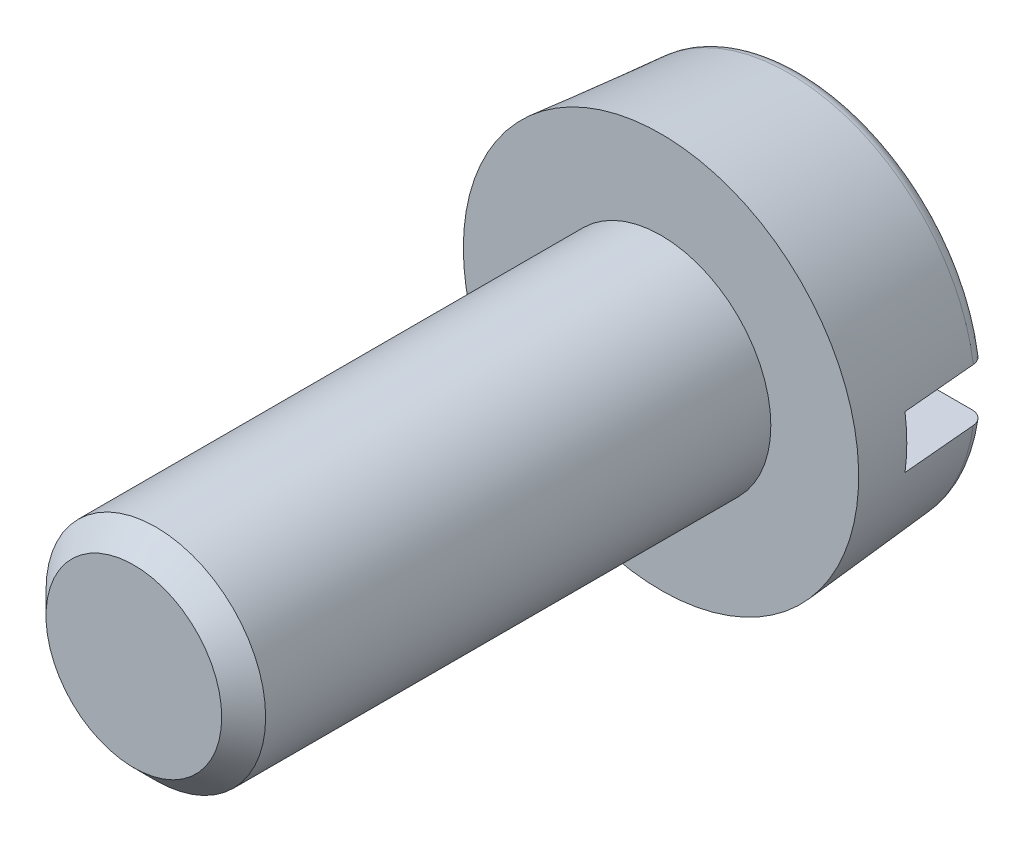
ISO-10303-21;
HEADER;
FILE_DESCRIPTION(('STEP AP214'),'2;1');
FILE_NAME('part.step','',(''),(''),'','','');
FILE_SCHEMA(('AUTOMOTIVE_DESIGN { 1 0 10303 214 1 1 1 1 }'));
ENDSEC;
DATA;
#1=APPLICATION_CONTEXT('core data for automotive mechanical design processes');
#2=APPLICATION_PROTOCOL_DEFINITION('international standard','automotive_design',2000,#1);
#3=PRODUCT_CONTEXT('',#1,'mechanical');
#4=PRODUCT('Part','Part','',(#3));
#5=PRODUCT_RELATED_PRODUCT_CATEGORY('part','',(#4));
#6=PRODUCT_DEFINITION_FORMATION('','',#4);
#7=PRODUCT_DEFINITION_CONTEXT('part definition',#1,'design');
#8=PRODUCT_DEFINITION('design','',#6,#7);
#9=PRODUCT_DEFINITION_SHAPE('','',#8);
#10=(LENGTH_UNIT() NAMED_UNIT(*) SI_UNIT(.MILLI.,.METRE.));
#11=(NAMED_UNIT(*) PLANE_ANGLE_UNIT() SI_UNIT($,.RADIAN.));
#12=(NAMED_UNIT(*) SI_UNIT($,.STERADIAN.) SOLID_ANGLE_UNIT());
#13=UNCERTAINTY_MEASURE_WITH_UNIT(LENGTH_MEASURE(1.E-05),#10,'distance_accuracy_value','');
#14=(GEOMETRIC_REPRESENTATION_CONTEXT(3) GLOBAL_UNCERTAINTY_ASSIGNED_CONTEXT((#13)) GLOBAL_UNIT_ASSIGNED_CONTEXT((#10,
#11,#12)) REPRESENTATION_CONTEXT('',''));
#15=CARTESIAN_POINT('',(0.,0.,0.));
#16=DIRECTION('',(0.,0.,1.));
#17=DIRECTION('',(1.,0.,0.));
#18=AXIS2_PLACEMENT_3D('',#15,#16,#17);
#19=CARTESIAN_POINT('',(0.,0.,-1.6));
#20=DIRECTION('',(0.,0.,1.));
#21=DIRECTION('',(1.,0.,0.));
#22=AXIS2_PLACEMENT_3D('',#19,#20,#21);
#23=PLANE('',#22);
#24=DIRECTION('',(1.,0.,0.));
#25=VECTOR('',#24,1.);
#26=CARTESIAN_POINT('',(-2.25,-0.3,-1.6));
#27=LINE('',#26,#25);
#28=CARTESIAN_POINT('',(-1.94035042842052,-0.3,-1.6));
#29=VERTEX_POINT('',#28);
#30=CARTESIAN_POINT('',(1.94035042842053,-0.3,-1.6));
#31=VERTEX_POINT('',#30);
#32=EDGE_CURVE('E180',#29,#31,#27,.T.);
#33=ORIENTED_EDGE('',*,*,#32,.T.);
#34=CARTESIAN_POINT('',(0.,0.,-1.6));
#35=DIRECTION('',(0.,0.,-1.));
#36=DIRECTION('',(-1.,0.,0.));
#37=AXIS2_PLACEMENT_3D('',#34,#35,#36);
#38=CIRCLE('',#37,1.96340515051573);
#39=EDGE_CURVE('E110',#31,#29,#38,.T.);
#40=ORIENTED_EDGE('',*,*,#39,.T.);
#41=EDGE_LOOP('',(#33,#40));
#42=FACE_BOUND('',#41,.T.);
#43=ADVANCED_FACE('F29',(#42),#23,.F.);
#44=DIRECTION('',(-1.,0.,0.));
#45=VECTOR('',#44,1.);
#46=CARTESIAN_POINT('',(-2.25,0.3,-1.6));
#47=LINE('',#46,#45);
#48=CARTESIAN_POINT('',(1.94035042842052,0.3,-1.6));
#49=VERTEX_POINT('',#48);
#50=CARTESIAN_POINT('',(-1.94035042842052,0.3,-1.6));
#51=VERTEX_POINT('',#50);
#52=EDGE_CURVE('E97',#49,#51,#47,.T.);
#53=ORIENTED_EDGE('',*,*,#52,.T.);
#54=EDGE_CURVE('E107',#51,#49,#38,.T.);
#55=ORIENTED_EDGE('',*,*,#54,.T.);
#56=EDGE_LOOP('',(#53,#55));
#57=FACE_BOUND('',#56,.T.);
#58=ADVANCED_FACE('F174',(#57),#23,.F.);
#59=CARTESIAN_POINT('',(0.,0.,-1.44));
#60=DIRECTION('',(0.,0.,-1.));
#61=DIRECTION('',(-1.,0.,0.));
#62=AXIS2_PLACEMENT_3D('',#59,#60,#61);
#63=TOROIDAL_SURFACE('',#62,1.96340515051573,0.16);
#64=CARTESIAN_POINT('',(-2.06921525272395,-0.3,-1.53673639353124));
#65=CARTESIAN_POINT('',(-2.0746550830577,-0.3,-1.52964326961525));
#66=CARTESIAN_POINT('',(-2.0795032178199,-0.3,-1.52208864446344));
#67=CARTESIAN_POINT('',(-2.08786804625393,-0.3,-1.50626748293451));
#68=CARTESIAN_POINT('',(-2.09138328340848,-0.3,-1.49800017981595));
#69=CARTESIAN_POINT('',(-2.09697215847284,-0.3,-1.48099261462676));
#70=CARTESIAN_POINT('',(-2.09904607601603,-0.3,-1.47225244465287));
#71=CARTESIAN_POINT('',(-2.1016898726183,-0.3,-1.45454966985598));
#72=CARTESIAN_POINT('',(-2.10226010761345,-0.3,-1.44558711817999));
#73=CARTESIAN_POINT('',(-2.10188127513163,-0.3,-1.42772878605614));
#74=CARTESIAN_POINT('',(-2.10093804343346,-0.3,-1.41883288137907));
#75=CARTESIAN_POINT('',(-2.09757146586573,-0.3,-1.4013255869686));
#76=CARTESIAN_POINT('',(-2.09514808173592,-0.3,-1.39271420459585));
#77=CARTESIAN_POINT('',(-2.08889300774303,-0.3,-1.3760180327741));
#78=CARTESIAN_POINT('',(-2.08506112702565,-0.3,-1.36793331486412));
#79=CARTESIAN_POINT('',(-2.07610212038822,-0.3,-1.35251685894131));
#80=CARTESIAN_POINT('',(-2.07097496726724,-0.3,-1.34518513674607));
#81=CARTESIAN_POINT('',(-2.05954034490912,-0.3,-1.33143462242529));
#82=CARTESIAN_POINT('',(-2.0532260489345,-0.3,-1.3250215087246));
#83=CARTESIAN_POINT('',(-2.03961957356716,-0.3,-1.31333402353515));
#84=CARTESIAN_POINT('',(-2.03232734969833,-0.3,-1.30805970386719));
#85=CARTESIAN_POINT('',(-2.01689652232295,-0.3,-1.29874428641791));
#86=CARTESIAN_POINT('',(-2.0087503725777,-0.3,-1.29471568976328));
#87=CARTESIAN_POINT('',(-1.99190207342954,-0.3,-1.28806773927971));
#88=CARTESIAN_POINT('',(-1.98319989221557,-0.3,-1.28544846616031));
#89=CARTESIAN_POINT('',(-1.9653927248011,-0.3,-1.28166733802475));
#90=CARTESIAN_POINT('',(-1.95628456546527,-0.3,-1.28052042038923));
#91=CARTESIAN_POINT('',(-1.9380044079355,-0.3,-1.27976148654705));
#92=CARTESIAN_POINT('',(-1.92883240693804,-0.3,-1.28014953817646));
#93=CARTESIAN_POINT('',(-1.91062403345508,-0.3,-1.28245633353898));
#94=CARTESIAN_POINT('',(-1.90158887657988,-0.3,-1.28438468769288));
#95=CARTESIAN_POINT('',(-1.8839706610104,-0.3,-1.28973193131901));
#96=CARTESIAN_POINT('',(-1.87538760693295,-0.3,-1.29315083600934));
#97=CARTESIAN_POINT('',(-1.85892739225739,-0.3,-1.30138357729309));
#98=CARTESIAN_POINT('',(-1.85104964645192,-0.3,-1.30619624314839));
#99=CARTESIAN_POINT('',(-1.83622296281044,-0.3,-1.31708660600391));
#100=CARTESIAN_POINT('',(-1.8292739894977,-0.3,-1.32316425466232));
#101=CARTESIAN_POINT('',(-1.81656874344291,-0.3,-1.33635833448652));
#102=CARTESIAN_POINT('',(-1.81080270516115,-0.3,-1.34346535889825));
#103=CARTESIAN_POINT('',(-1.80056433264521,-0.3,-1.35855724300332));
#104=CARTESIAN_POINT('',(-1.79609190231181,-0.3,-1.36654203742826));
#105=CARTESIAN_POINT('',(-1.78862931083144,-0.3,-1.3830515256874));
#106=CARTESIAN_POINT('',(-1.78562063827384,-0.3,-1.39156785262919));
#107=CARTESIAN_POINT('',(-1.78109353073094,-0.3,-1.40898771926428));
#108=CARTESIAN_POINT('',(-1.77957499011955,-0.3,-1.41789123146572));
#109=CARTESIAN_POINT('',(-1.77808415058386,-0.3,-1.43572905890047));
#110=CARTESIAN_POINT('',(-1.7780952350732,-0.3,-1.44466198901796));
#111=CARTESIAN_POINT('',(-1.77962174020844,-0.3,-1.46239814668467));
#112=CARTESIAN_POINT('',(-1.78113711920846,-0.3,-1.47120137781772));
#113=CARTESIAN_POINT('',(-1.78561880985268,-0.3,-1.48840356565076));
#114=CARTESIAN_POINT('',(-1.78858103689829,-0.3,-1.49680358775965));
#115=CARTESIAN_POINT('',(-1.7958645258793,-0.3,-1.51299186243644));
#116=CARTESIAN_POINT('',(-1.80018582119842,-0.3,-1.52078009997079));
#117=CARTESIAN_POINT('',(-1.81009248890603,-0.3,-1.53558192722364));
#118=CARTESIAN_POINT('',(-1.81568615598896,-0.3,-1.54258996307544));
#119=CARTESIAN_POINT('',(-1.82795738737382,-0.3,-1.55558203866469));
#120=CARTESIAN_POINT('',(-1.83463502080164,-0.3,-1.56156601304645));
#121=CARTESIAN_POINT('',(-1.84897346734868,-0.3,-1.57241987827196));
#122=CARTESIAN_POINT('',(-1.8566455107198,-0.3,-1.57727493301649));
#123=CARTESIAN_POINT('',(-1.87268838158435,-0.3,-1.58564579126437));
#124=CARTESIAN_POINT('',(-1.88105925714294,-0.3,-1.58916150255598));
#125=CARTESIAN_POINT('',(-1.89836915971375,-0.3,-1.59479508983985));
#126=CARTESIAN_POINT('',(-1.90731375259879,-0.3,-1.59689587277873));
#127=CARTESIAN_POINT('',(-1.92542786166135,-0.3,-1.59957571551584));
#128=CARTESIAN_POINT('',(-1.93459737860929,-0.3,-1.60015477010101));
#129=CARTESIAN_POINT('',(-1.95295751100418,-0.3,-1.59977353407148));
#130=CARTESIAN_POINT('',(-1.96214794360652,-0.3,-1.59880435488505));
#131=CARTESIAN_POINT('',(-1.98023748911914,-0.3,-1.59533333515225));
#132=CARTESIAN_POINT('',(-1.98913652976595,-0.3,-1.59283111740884));
#133=CARTESIAN_POINT('',(-2.00637042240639,-0.3,-1.58636553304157));
#134=CARTESIAN_POINT('',(-2.01470613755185,-0.3,-1.58240446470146));
#135=CARTESIAN_POINT('',(-2.03057891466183,-0.3,-1.57313009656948));
#136=CARTESIAN_POINT('',(-2.0381169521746,-0.3,-1.56781847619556));
#137=CARTESIAN_POINT('',(-2.04959677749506,-0.3,-1.55816464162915));
#138=CARTESIAN_POINT('',(-2.05384442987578,-0.3,-1.55418005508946));
#139=CARTESIAN_POINT('',(-2.06188335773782,-0.3,-1.54577427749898));
#140=CARTESIAN_POINT('',(-2.06567463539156,-0.3,-1.54135308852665));
#141=CARTESIAN_POINT('',(-2.06921525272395,-0.3,-1.53673639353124));
#142=B_SPLINE_CURVE_WITH_KNOTS('',3,(#64,#65,#66,#67,#68,#69,#70,#71,#72,#73,#74,#75,#76,#77,
#78,#79,#80,#81,#82,#83,#84,#85,#86,#87,#88,#89,#90,#91,#92,#93,#94,#95,#96,#97,#98,#99,#100,
#101,#102,#103,#104,#105,#106,#107,#108,#109,#110,#111,#112,#113,#114,#115,#116,#117,#118,#119,
#120,#121,#122,#123,#124,#125,#126,#127,#128,#129,#130,#131,#132,#133,#134,#135,#136,#137,#138,
#139,#140,#141),.UNSPECIFIED.,.T.,.F.,(4,2,2,2,2,2,2,2,2,2,2,2,2,2,2,2,2,2,2,2,2,2,2,2,2,2,2,2,
2,2,2,2,2,2,2,2,2,2,4),(0.,0.0267957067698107,0.0536206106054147,0.0804403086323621,
0.107253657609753,0.133963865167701,0.160674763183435,0.187389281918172,0.214104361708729,
0.240978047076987,0.267852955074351,0.294989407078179,0.322127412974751,0.349538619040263,
0.376951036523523,0.404535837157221,0.432120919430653,0.459682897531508,0.487243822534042,
0.514567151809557,0.54188845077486,0.568854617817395,0.595818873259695,0.622490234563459,
0.649160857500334,0.675756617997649,0.702353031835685,0.729128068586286,0.755904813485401,
0.783015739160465,0.810128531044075,0.837563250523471,0.864998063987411,0.892590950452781,
0.920190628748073,0.947747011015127,0.975269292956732,0.992709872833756,1.0101503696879),.UNSPECIFIED.);
#143=CARTESIAN_POINT('',(-2.10149093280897,-0.3,-1.45394491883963));
#144=VERTEX_POINT('',#143);
#145=EDGE_CURVE('E87',#29,#144,#142,.T.);
#146=ORIENTED_EDGE('',*,*,#145,.F.);
#147=ORIENTED_EDGE('',*,*,#39,.F.);
#148=CARTESIAN_POINT('',(1.80073063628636,-0.3,-1.5212145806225));
#149=CARTESIAN_POINT('',(1.79616751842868,-0.3,-1.51357358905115));
#150=CARTESIAN_POINT('',(1.79224189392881,-0.3,-1.50554488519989));
#151=CARTESIAN_POINT('',(1.78578922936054,-0.3,-1.48893672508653));
#152=CARTESIAN_POINT('',(1.78326367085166,-0.3,-1.48035669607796));
#153=CARTESIAN_POINT('',(1.77969332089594,-0.3,-1.46289428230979));
#154=CARTESIAN_POINT('',(1.77864829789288,-0.3,-1.45401194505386));
#155=CARTESIAN_POINT('',(1.7780715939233,-0.3,-1.43620044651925));
#156=CARTESIAN_POINT('',(1.77853956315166,-0.3,-1.42727129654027));
#157=CARTESIAN_POINT('',(1.7809684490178,-0.3,-1.40965441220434));
#158=CARTESIAN_POINT('',(1.78292349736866,-0.3,-1.40096586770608));
#159=CARTESIAN_POINT('',(1.78825957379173,-0.3,-1.38403829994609));
#160=CARTESIAN_POINT('',(1.79164066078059,-0.3,-1.37579929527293));
#161=CARTESIAN_POINT('',(1.79974124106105,-0.3,-1.35997114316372));
#162=CARTESIAN_POINT('',(1.80446545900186,-0.3,-1.35238441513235));
#163=CARTESIAN_POINT('',(1.81510732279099,-0.3,-1.33810039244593));
#164=CARTESIAN_POINT('',(1.82102502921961,-0.3,-1.33140314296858));
#165=CARTESIAN_POINT('',(1.83395518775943,-0.3,-1.31900739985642));
#166=CARTESIAN_POINT('',(1.84097909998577,-0.3,-1.31332086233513));
#167=CARTESIAN_POINT('',(1.85587176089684,-0.3,-1.30318988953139));
#168=CARTESIAN_POINT('',(1.86374056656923,-0.3,-1.29874553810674));
#169=CARTESIAN_POINT('',(1.88020809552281,-0.3,-1.29116651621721));
#170=CARTESIAN_POINT('',(1.88881487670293,-0.3,-1.28804934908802));
#171=CARTESIAN_POINT('',(1.90642722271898,-0.3,-1.28329055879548));
#172=CARTESIAN_POINT('',(1.91543280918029,-0.3,-1.28164901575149));
#173=CARTESIAN_POINT('',(1.93366797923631,-0.3,-1.279878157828));
#174=CARTESIAN_POINT('',(1.94289880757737,-0.3,-1.2797616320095));
#175=CARTESIAN_POINT('',(1.96124943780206,-0.3,-1.2810785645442));
#176=CARTESIAN_POINT('',(1.97036923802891,-0.3,-1.28251204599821));
#177=CARTESIAN_POINT('',(1.98824435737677,-0.3,-1.2868940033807));
#178=CARTESIAN_POINT('',(1.99699941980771,-0.3,-1.28984352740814));
#179=CARTESIAN_POINT('',(2.01388533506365,-0.3,-1.29717990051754));
#180=CARTESIAN_POINT('',(2.02201620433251,-0.3,-1.30156671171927));
#181=CARTESIAN_POINT('',(2.03736528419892,-0.3,-1.31162524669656));
#182=CARTESIAN_POINT('',(2.04458903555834,-0.3,-1.31728851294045));
#183=CARTESIAN_POINT('',(2.05797086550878,-0.3,-1.32975885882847));
#184=CARTESIAN_POINT('',(2.06412900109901,-0.3,-1.33656587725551));
#185=CARTESIAN_POINT('',(2.07513756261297,-0.3,-1.35105624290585));
#186=CARTESIAN_POINT('',(2.08000068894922,-0.3,-1.35872994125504));
#187=CARTESIAN_POINT('',(2.08835492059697,-0.3,-1.3747910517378));
#188=CARTESIAN_POINT('',(2.09184610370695,-0.3,-1.38317842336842));
#189=CARTESIAN_POINT('',(2.09732351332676,-0.3,-1.40034139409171));
#190=CARTESIAN_POINT('',(2.09932396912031,-0.3,-1.40911245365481));
#191=CARTESIAN_POINT('',(2.10181470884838,-0.3,-1.42686635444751));
#192=CARTESIAN_POINT('',(2.10230505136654,-0.3,-1.43584918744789));
#193=CARTESIAN_POINT('',(2.10176235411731,-0.3,-1.45371811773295));
#194=CARTESIAN_POINT('',(2.10073782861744,-0.3,-1.46260447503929));
#195=CARTESIAN_POINT('',(2.09721171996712,-0.3,-1.48007896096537));
#196=CARTESIAN_POINT('',(2.09471014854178,-0.3,-1.48866709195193));
#197=CARTESIAN_POINT('',(2.08830346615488,-0.3,-1.5053056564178));
#198=CARTESIAN_POINT('',(2.08439791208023,-0.3,-1.5133559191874));
#199=CARTESIAN_POINT('',(2.07529851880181,-0.3,-1.52869179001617));
#200=CARTESIAN_POINT('',(2.07010465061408,-0.3,-1.53597738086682));
#201=CARTESIAN_POINT('',(2.05854423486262,-0.3,-1.54962600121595));
#202=CARTESIAN_POINT('',(2.05217075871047,-0.3,-1.55598316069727));
#203=CARTESIAN_POINT('',(2.03845607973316,-0.3,-1.56754978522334));
#204=CARTESIAN_POINT('',(2.03111482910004,-0.3,-1.57275919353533));
#205=CARTESIAN_POINT('',(2.01559651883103,-0.3,-1.58193724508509));
#206=CARTESIAN_POINT('',(2.00741198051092,-0.3,-1.5858932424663));
#207=CARTESIAN_POINT('',(1.99049946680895,-0.3,-1.59239056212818));
#208=CARTESIAN_POINT('',(1.98177145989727,-0.3,-1.59493180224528));
#209=CARTESIAN_POINT('',(1.96392595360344,-0.3,-1.59855264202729));
#210=CARTESIAN_POINT('',(1.95480542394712,-0.3,-1.5996173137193));
#211=CARTESIAN_POINT('',(1.93651475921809,-0.3,-1.60021053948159));
#212=CARTESIAN_POINT('',(1.92734462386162,-0.3,-1.59973908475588));
#213=CARTESIAN_POINT('',(1.90915640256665,-0.3,-1.59726643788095));
#214=CARTESIAN_POINT('',(1.90013956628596,-0.3,-1.59525604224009));
#215=CARTESIAN_POINT('',(1.88256926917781,-0.3,-1.58974791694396));
#216=CARTESIAN_POINT('',(1.87401592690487,-0.3,-1.58624980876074));
#217=CARTESIAN_POINT('',(1.85762682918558,-0.3,-1.57786392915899));
#218=CARTESIAN_POINT('',(1.84979066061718,-0.3,-1.5729769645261));
#219=CARTESIAN_POINT('',(1.83506678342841,-0.3,-1.56194893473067));
#220=CARTESIAN_POINT('',(1.82817791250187,-0.3,-1.55580942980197));
#221=CARTESIAN_POINT('',(1.81784779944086,-0.3,-1.54488243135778));
#222=CARTESIAN_POINT('',(1.81406330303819,-0.3,-1.54041414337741));
#223=CARTESIAN_POINT('',(1.80700428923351,-0.3,-1.53109125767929));
#224=CARTESIAN_POINT('',(1.8037297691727,-0.3,-1.52623666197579));
#225=CARTESIAN_POINT('',(1.80073063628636,-0.3,-1.5212145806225));
#226=B_SPLINE_CURVE_WITH_KNOTS('',3,(#148,#149,#150,#151,#152,#153,#154,#155,#156,#157,#158,
#159,#160,#161,#162,#163,#164,#165,#166,#167,#168,#169,#170,#171,#172,#173,#174,#175,#176,#177,
#178,#179,#180,#181,#182,#183,#184,#185,#186,#187,#188,#189,#190,#191,#192,#193,#194,#195,#196,
#197,#198,#199,#200,#201,#202,#203,#204,#205,#206,#207,#208,#209,#210,#211,#212,#213,#214,#215,
#216,#217,#218,#219,#220,#221,#222,#223,#224,#225),.UNSPECIFIED.,.T.,.F.,(4,2,2,2,2,2,2,2,2,2,2,
2,2,2,2,2,2,2,2,2,2,2,2,2,2,2,2,2,2,2,2,2,2,2,2,2,2,2,4),(0.,0.0266783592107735,
0.0533848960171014,0.0800872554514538,0.106783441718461,0.133374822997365,0.159967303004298,
0.18665450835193,0.213343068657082,0.240328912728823,0.267316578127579,0.294649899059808,
0.321984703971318,0.349548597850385,0.377112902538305,0.404696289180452,0.432278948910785,
0.459683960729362,0.487087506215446,0.514211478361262,0.541333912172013,0.568194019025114,
0.59505308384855,0.621761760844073,0.648470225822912,0.675187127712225,0.701904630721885,
0.728784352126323,0.755665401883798,0.782809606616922,0.809955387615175,0.83737365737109,
0.864792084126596,0.892375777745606,0.919966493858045,0.947541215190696,0.975081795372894,
0.992616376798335,1.01015086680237),.UNSPECIFIED.);
#227=CARTESIAN_POINT('',(2.10149093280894,-0.3,-1.45394491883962));
#228=VERTEX_POINT('',#227);
#229=EDGE_CURVE('E186',#228,#31,#226,.T.);
#230=ORIENTED_EDGE('',*,*,#229,.F.);
#231=CARTESIAN_POINT('',(0.,0.,-1.45394491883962));
#232=DIRECTION('',(0.,0.,-1.));
#233=DIRECTION('',(-1.,0.,0.));
#234=AXIS2_PLACEMENT_3D('',#231,#232,#233);
#235=CIRCLE('',#234,2.12279630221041);
#236=EDGE_CURVE('E119',#228,#144,#235,.T.);
#237=ORIENTED_EDGE('',*,*,#236,.T.);
#238=EDGE_LOOP('',(#146,#147,#230,#237));
#239=FACE_BOUND('',#238,.T.);
#240=ADVANCED_FACE('F132',(#239),#63,.T.);
#241=CARTESIAN_POINT('',(-2.06921525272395,0.3,-1.53673639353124));
#242=CARTESIAN_POINT('',(-2.06369836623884,0.3,-1.54392865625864));
#243=CARTESIAN_POINT('',(-2.05756490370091,0.3,-1.5506568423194));
#244=CARTESIAN_POINT('',(-2.04424737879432,0.3,-1.56299026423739));
#245=CARTESIAN_POINT('',(-2.03706193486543,0.3,-1.56859400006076));
#246=CARTESIAN_POINT('',(-2.02186046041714,0.3,-1.5785142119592));
#247=CARTESIAN_POINT('',(-2.01384520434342,0.3,-1.58283187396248));
#248=CARTESIAN_POINT('',(-1.99721015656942,0.3,-1.59007051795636));
#249=CARTESIAN_POINT('',(-1.98859051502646,0.3,-1.59299184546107));
#250=CARTESIAN_POINT('',(-1.97091889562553,0.3,-1.59738115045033));
#251=CARTESIAN_POINT('',(-1.9618641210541,0.3,-1.59883786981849));
#252=CARTESIAN_POINT('',(-1.94363793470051,0.3,-1.60022195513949));
#253=CARTESIAN_POINT('',(-1.93446651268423,0.3,-1.60014918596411));
#254=CARTESIAN_POINT('',(-1.91620121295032,0.3,-1.59847164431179));
#255=CARTESIAN_POINT('',(-1.90710829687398,0.3,-1.59685638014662));
#256=CARTESIAN_POINT('',(-1.88932235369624,0.3,-1.59212245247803));
#257=CARTESIAN_POINT('',(-1.88062933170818,0.3,-1.58900376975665));
#258=CARTESIAN_POINT('',(-1.86389238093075,0.3,-1.58134698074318));
#259=CARTESIAN_POINT('',(-1.85584844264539,0.3,-1.57680889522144));
#260=CARTESIAN_POINT('',(-1.84064450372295,0.3,-1.5664365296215));
#261=CARTESIAN_POINT('',(-1.83348447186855,0.3,-1.56060229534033));
#262=CARTESIAN_POINT('',(-1.82031483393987,0.3,-1.54784997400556));
#263=CARTESIAN_POINT('',(-1.81429657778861,0.3,-1.54094082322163));
#264=CARTESIAN_POINT('',(-1.80352346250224,0.3,-1.52619902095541));
#265=CARTESIAN_POINT('',(-1.79876851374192,0.3,-1.51836643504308));
#266=CARTESIAN_POINT('',(-1.79072206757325,0.3,-1.50210759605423));
#267=CARTESIAN_POINT('',(-1.78741259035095,0.3,-1.49369024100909));
#268=CARTESIAN_POINT('',(-1.78227227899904,0.3,-1.4764155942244));
#269=CARTESIAN_POINT('',(-1.78044133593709,0.3,-1.46755833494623));
#270=CARTESIAN_POINT('',(-1.77832798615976,0.3,-1.44976367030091));
#271=CARTESIAN_POINT('',(-1.77802816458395,0.3,-1.44082832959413));
#272=CARTESIAN_POINT('',(-1.77893928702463,0.3,-1.42303522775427));
#273=CARTESIAN_POINT('',(-1.78015018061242,0.3,-1.41417746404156));
#274=CARTESIAN_POINT('',(-1.78403752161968,0.3,-1.39682534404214));
#275=CARTESIAN_POINT('',(-1.78670839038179,0.3,-1.3883297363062));
#276=CARTESIAN_POINT('',(-1.79343043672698,0.3,-1.37190368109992));
#277=CARTESIAN_POINT('',(-1.79748164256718,0.3,-1.36397324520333));
#278=CARTESIAN_POINT('',(-1.80687098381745,0.3,-1.34885079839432));
#279=CARTESIAN_POINT('',(-1.81221649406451,0.3,-1.3416633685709));
#280=CARTESIAN_POINT('',(-1.82402491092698,0.3,-1.32827425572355));
#281=CARTESIAN_POINT('',(-1.83048788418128,0.3,-1.32207263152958));
#282=CARTESIAN_POINT('',(-1.84443136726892,0.3,-1.31075019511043));
#283=CARTESIAN_POINT('',(-1.85192330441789,0.3,-1.30564345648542));
#284=CARTESIAN_POINT('',(-1.8676499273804,0.3,-1.29674237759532));
#285=CARTESIAN_POINT('',(-1.87588466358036,0.3,-1.29294812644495));
#286=CARTESIAN_POINT('',(-1.89297138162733,0.3,-1.28673328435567));
#287=CARTESIAN_POINT('',(-1.90182967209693,0.3,-1.28433003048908));
#288=CARTESIAN_POINT('',(-1.91982304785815,0.3,-1.28103375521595));
#289=CARTESIAN_POINT('',(-1.92895814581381,0.3,-1.28014080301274));
#290=CARTESIAN_POINT('',(-1.94731042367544,0.3,-1.27988917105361));
#291=CARTESIAN_POINT('',(-1.95652774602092,0.3,-1.280540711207));
#292=CARTESIAN_POINT('',(-1.9747219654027,0.3,-1.28338379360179));
#293=CARTESIAN_POINT('',(-1.98369886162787,0.3,-1.28557534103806));
#294=CARTESIAN_POINT('',(-2.00114373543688,0.3,-1.29143747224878));
#295=CARTESIAN_POINT('',(-2.00961234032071,0.3,-1.29510618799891));
#296=CARTESIAN_POINT('',(-2.02580669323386,0.3,-1.30382407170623));
#297=CARTESIAN_POINT('',(-2.03353246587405,0.3,-1.3088731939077));
#298=CARTESIAN_POINT('',(-2.04795635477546,0.3,-1.32016835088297));
#299=CARTESIAN_POINT('',(-2.05466197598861,0.3,-1.32640479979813));
#300=CARTESIAN_POINT('',(-2.06691739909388,0.3,-1.33992556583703));
#301=CARTESIAN_POINT('',(-2.07246726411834,0.3,-1.34720982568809));
#302=CARTESIAN_POINT('',(-2.08219213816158,0.3,-1.36253771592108));
#303=CARTESIAN_POINT('',(-2.08638090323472,0.3,-1.37057261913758));
#304=CARTESIAN_POINT('',(-2.09333584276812,0.3,-1.38723582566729));
#305=CARTESIAN_POINT('',(-2.09610215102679,0.3,-1.39586407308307));
#306=CARTESIAN_POINT('',(-2.10011005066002,0.3,-1.41338531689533));
#307=CARTESIAN_POINT('',(-2.10136520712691,0.3,-1.42227521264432));
#308=CARTESIAN_POINT('',(-2.10235836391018,0.3,-1.44014172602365));
#309=CARTESIAN_POINT('',(-2.10209602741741,0.3,-1.44911836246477));
#310=CARTESIAN_POINT('',(-2.10006579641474,0.3,-1.46686449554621));
#311=CARTESIAN_POINT('',(-2.0983035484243,0.3,-1.47563464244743));
#312=CARTESIAN_POINT('',(-2.09333445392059,0.3,-1.49274748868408));
#313=CARTESIAN_POINT('',(-2.0901293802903,0.3,-1.50109069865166));
#314=CARTESIAN_POINT('',(-2.0838931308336,0.3,-1.51398297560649));
#315=CARTESIAN_POINT('',(-2.08128341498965,0.3,-1.5187406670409));
#316=CARTESIAN_POINT('',(-2.07559441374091,0.3,-1.52796638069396));
#317=CARTESIAN_POINT('',(-2.07251513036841,0.3,-1.53243440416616));
#318=CARTESIAN_POINT('',(-2.06921525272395,0.3,-1.53673639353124));
#319=B_SPLINE_CURVE_WITH_KNOTS('',3,(#241,#242,#243,#244,#245,#246,#247,#248,#249,#250,#251,
#252,#253,#254,#255,#256,#257,#258,#259,#260,#261,#262,#263,#264,#265,#266,#267,#268,#269,#270,
#271,#272,#273,#274,#275,#276,#277,#278,#279,#280,#281,#282,#283,#284,#285,#286,#287,#288,#289,
#290,#291,#292,#293,#294,#295,#296,#297,#298,#299,#300,#301,#302,#303,#304,#305,#306,#307,#308,
#309,#310,#311,#312,#313,#314,#315,#316,#317,#318),.UNSPECIFIED.,.T.,.F.,(4,2,2,2,2,2,2,2,2,2,2,
2,2,2,2,2,2,2,2,2,2,2,2,2,2,2,2,2,2,2,2,2,2,2,2,2,2,2,4),(0.,0.0271733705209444,
0.0543827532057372,0.0815669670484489,0.108744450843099,0.13612928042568,0.163516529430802,
0.191091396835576,0.218666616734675,0.246241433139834,0.273815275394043,0.301171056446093,
0.328524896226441,0.355528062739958,0.382529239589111,0.409222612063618,0.435915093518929,
0.462506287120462,0.489098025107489,0.515845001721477,0.542593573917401,0.569667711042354,
0.596743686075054,0.624150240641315,0.651558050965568,0.679147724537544,0.706737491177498,
0.734292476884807,0.761846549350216,0.789186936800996,0.816525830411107,0.843579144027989,
0.870629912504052,0.897436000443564,0.924248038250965,0.950959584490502,0.977638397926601,
0.993891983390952,1.01014549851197),.UNSPECIFIED.);
#320=CARTESIAN_POINT('',(-2.10149093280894,0.3,-1.45394491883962));
#321=VERTEX_POINT('',#320);
#322=EDGE_CURVE('E123',#321,#51,#319,.T.);
#323=ORIENTED_EDGE('',*,*,#322,.F.);
#324=CARTESIAN_POINT('',(2.10149093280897,0.3,-1.45394491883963));
#325=VERTEX_POINT('',#324);
#326=EDGE_CURVE('E115',#321,#325,#235,.T.);
#327=ORIENTED_EDGE('',*,*,#326,.T.);
#328=CARTESIAN_POINT('',(1.80073063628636,0.3,-1.5212145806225));
#329=CARTESIAN_POINT('',(1.80537421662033,0.3,-1.52898871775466));
#330=CARTESIAN_POINT('',(1.81068466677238,0.3,-1.53637282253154));
#331=CARTESIAN_POINT('',(1.82247832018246,0.3,-1.5501473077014));
#332=CARTESIAN_POINT('',(1.82896310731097,0.3,-1.55653632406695));
#333=CARTESIAN_POINT('',(1.8429038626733,0.3,-1.56813294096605));
#334=CARTESIAN_POINT('',(1.85035882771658,0.3,-1.57334174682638));
#335=CARTESIAN_POINT('',(1.86602857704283,0.3,-1.58244549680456));
#336=CARTESIAN_POINT('',(1.87424317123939,0.3,-1.58634076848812));
#337=CARTESIAN_POINT('',(1.89128140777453,0.3,-1.59274681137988));
#338=CARTESIAN_POINT('',(1.90010992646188,0.3,-1.59524461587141));
#339=CARTESIAN_POINT('',(1.91806028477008,0.3,-1.59873414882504));
#340=CARTESIAN_POINT('',(1.92718215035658,0.3,-1.59972574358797));
#341=CARTESIAN_POINT('',(1.9455267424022,0.3,-1.60017678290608));
#342=CARTESIAN_POINT('',(1.95474973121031,0.3,-1.59962565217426));
#343=CARTESIAN_POINT('',(1.97297216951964,0.3,-1.59698141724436));
#344=CARTESIAN_POINT('',(1.98197161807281,0.3,-1.59488830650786));
#345=CARTESIAN_POINT('',(1.99948027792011,0.3,-1.58921751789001));
#346=CARTESIAN_POINT('',(2.00798997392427,0.3,-1.58564133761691));
#347=CARTESIAN_POINT('',(2.02428168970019,0.3,-1.57710047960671));
#348=CARTESIAN_POINT('',(2.03206373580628,0.3,-1.5721358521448));
#349=CARTESIAN_POINT('',(2.04661462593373,0.3,-1.56099759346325));
#350=CARTESIAN_POINT('',(2.05339071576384,0.3,-1.55483343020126));
#351=CARTESIAN_POINT('',(2.06579835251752,0.3,-1.54144425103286));
#352=CARTESIAN_POINT('',(2.07142996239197,0.3,-1.53421929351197));
#353=CARTESIAN_POINT('',(2.08132631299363,0.3,-1.5189946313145));
#354=CARTESIAN_POINT('',(2.08560471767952,0.3,-1.51100380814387));
#355=CARTESIAN_POINT('',(2.09274512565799,0.3,-1.49441256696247));
#356=CARTESIAN_POINT('',(2.09560720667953,0.3,-1.48581218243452));
#357=CARTESIAN_POINT('',(2.0998087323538,0.3,-1.46832970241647));
#358=CARTESIAN_POINT('',(2.10116171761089,0.3,-1.45945085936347));
#359=CARTESIAN_POINT('',(2.10235052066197,0.3,-1.44159228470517));
#360=CARTESIAN_POINT('',(2.10218638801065,0.3,-1.43261255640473));
#361=CARTESIAN_POINT('',(2.10035010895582,0.3,-1.41484898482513));
#362=CARTESIAN_POINT('',(2.09868462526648,0.3,-1.40606445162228));
#363=CARTESIAN_POINT('',(2.09390477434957,0.3,-1.38889903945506));
#364=CARTESIAN_POINT('',(2.09079040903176,0.3,-1.38051815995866));
#365=CARTESIAN_POINT('',(2.08319886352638,0.3,-1.36438174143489));
#366=CARTESIAN_POINT('',(2.07871946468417,0.3,-1.35662724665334));
#367=CARTESIAN_POINT('',(2.06853104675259,0.3,-1.34197344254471));
#368=CARTESIAN_POINT('',(2.06282199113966,0.3,-1.33507415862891));
#369=CARTESIAN_POINT('',(2.05029449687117,0.3,-1.32227279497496));
#370=CARTESIAN_POINT('',(2.04346846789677,0.3,-1.31637814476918));
#371=CARTESIAN_POINT('',(2.02893217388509,0.3,-1.30580476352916));
#372=CARTESIAN_POINT('',(2.02122186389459,0.3,-1.30112609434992));
#373=CARTESIAN_POINT('',(2.00505214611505,0.3,-1.29306675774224));
#374=CARTESIAN_POINT('',(1.99658591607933,0.3,-1.28969977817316));
#375=CARTESIAN_POINT('',(1.97921160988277,0.3,-1.28441982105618));
#376=CARTESIAN_POINT('',(1.9703035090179,0.3,-1.28250692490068));
#377=CARTESIAN_POINT('',(1.95220748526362,0.3,-1.28017256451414));
#378=CARTESIAN_POINT('',(1.94301770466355,0.3,-1.27976548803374));
#379=CARTESIAN_POINT('',(1.92469907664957,0.3,-1.28049186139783));
#380=CARTESIAN_POINT('',(1.91557023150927,0.3,-1.28162536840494));
#381=CARTESIAN_POINT('',(1.89758691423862,0.3,-1.28541105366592));
#382=CARTESIAN_POINT('',(1.88873397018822,0.3,-1.28807049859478));
#383=CARTESIAN_POINT('',(1.87160183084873,0.3,-1.29484187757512));
#384=CARTESIAN_POINT('',(1.86332263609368,0.3,-1.29895381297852));
#385=CARTESIAN_POINT('',(1.84760060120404,0.3,-1.30850529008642));
#386=CARTESIAN_POINT('',(1.84015548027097,0.3,-1.31394107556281));
#387=CARTESIAN_POINT('',(1.82629524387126,0.3,-1.32599723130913));
#388=CARTESIAN_POINT('',(1.81988007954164,0.3,-1.33261754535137));
#389=CARTESIAN_POINT('',(1.80833350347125,0.3,-1.34678467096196));
#390=CARTESIAN_POINT('',(1.80318974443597,0.3,-1.35432141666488));
#391=CARTESIAN_POINT('',(1.79426051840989,0.3,-1.37016035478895));
#392=CARTESIAN_POINT('',(1.79047489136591,0.3,-1.37846245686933));
#393=CARTESIAN_POINT('',(1.78442090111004,0.3,-1.39547854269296));
#394=CARTESIAN_POINT('',(1.78213311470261,0.3,-1.40418561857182));
#395=CARTESIAN_POINT('',(1.77906678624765,0.3,-1.42186398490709));
#396=CARTESIAN_POINT('',(1.7782885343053,0.3,-1.43083532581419));
#397=CARTESIAN_POINT('',(1.77826638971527,0.3,-1.44869922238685));
#398=CARTESIAN_POINT('',(1.77900897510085,0.3,-1.45759177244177));
#399=CARTESIAN_POINT('',(1.7819782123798,0.3,-1.47511760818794));
#400=CARTESIAN_POINT('',(1.78420301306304,0.3,-1.48375120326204));
#401=CARTESIAN_POINT('',(1.78889967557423,0.3,-1.49719335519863));
#402=CARTESIAN_POINT('',(1.79092477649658,0.3,-1.50216268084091));
#403=CARTESIAN_POINT('',(1.79546553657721,0.3,-1.51187177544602));
#404=CARTESIAN_POINT('',(1.79798119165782,0.3,-1.5166115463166));
#405=CARTESIAN_POINT('',(1.80073063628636,0.3,-1.5212145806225));
#406=B_SPLINE_CURVE_WITH_KNOTS('',3,(#328,#329,#330,#331,#332,#333,#334,#335,#336,#337,#338,
#339,#340,#341,#342,#343,#344,#345,#346,#347,#348,#349,#350,#351,#352,#353,#354,#355,#356,#357,
#358,#359,#360,#361,#362,#363,#364,#365,#366,#367,#368,#369,#370,#371,#372,#373,#374,#375,#376,
#377,#378,#379,#380,#381,#382,#383,#384,#385,#386,#387,#388,#389,#390,#391,#392,#393,#394,#395,
#396,#397,#398,#399,#400,#401,#402,#403,#404,#405),.UNSPECIFIED.,.T.,.F.,(4,2,2,2,2,2,2,2,2,2,2,
2,2,2,2,2,2,2,2,2,2,2,2,2,2,2,2,2,2,2,2,2,2,2,2,2,2,2,4),(0.,0.0271462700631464,
0.0543294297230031,0.0814847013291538,0.108633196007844,0.136029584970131,0.163428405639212,
0.191015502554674,0.218602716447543,0.246162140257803,0.273720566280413,0.301069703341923,
0.328417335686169,0.355479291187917,0.382539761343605,0.409355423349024,0.43617020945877,
0.462866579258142,0.489562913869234,0.516302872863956,0.543043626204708,0.569974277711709,
0.596906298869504,0.624112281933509,0.651319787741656,0.678786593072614,0.706254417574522,
0.733854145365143,0.761453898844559,0.788976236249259,0.816497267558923,0.843739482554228,
0.870978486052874,0.897856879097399,0.924740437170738,0.951386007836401,0.977998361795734,
0.994071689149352,1.01014488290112),.UNSPECIFIED.);
#407=EDGE_CURVE('E128',#49,#325,#406,.T.);
#408=ORIENTED_EDGE('',*,*,#407,.F.);
#409=ORIENTED_EDGE('',*,*,#54,.F.);
#410=EDGE_LOOP('',(#323,#327,#408,#409));
#411=FACE_BOUND('',#410,.T.);
#412=ADVANCED_FACE('F159',(#411),#63,.T.);
#413=CARTESIAN_POINT('',(0.,0.,0.));
#414=DIRECTION('',(0.,0.,1.));
#415=DIRECTION('',(1.,0.,0.));
#416=AXIS2_PLACEMENT_3D('',#413,#414,#415);
#417=CONICAL_SURFACE('',#416,2.25,0.0872664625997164);
#418=CARTESIAN_POINT('',(0.,0.,0.));
#419=DIRECTION('',(0.,0.,-1.));
#420=DIRECTION('',(-1.,0.,0.));
#421=AXIS2_PLACEMENT_3D('',#418,#419,#420);
#422=CIRCLE('',#421,2.25);
#423=CARTESIAN_POINT('',(-2.25,0.,0.));
#424=VERTEX_POINT('',#423);
#425=EDGE_CURVE('E120',#424,#424,#422,.T.);
#426=ORIENTED_EDGE('',*,*,#425,.T.);
#427=EDGE_LOOP('',(#426));
#428=FACE_BOUND('',#427,.T.);
#429=CARTESIAN_POINT('',(-2.48439212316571,0.3,2.88539844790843));
#430=CARTESIAN_POINT('',(-2.42634360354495,0.3,2.22669430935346));
#431=CARTESIAN_POINT('',(-2.36826752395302,0.3,1.56799259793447));
#432=CARTESIAN_POINT('',(-2.2520427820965,0.3,0.250595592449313));
#433=CARTESIAN_POINT('',(-2.19389411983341,0.3,-0.408099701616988));
#434=CARTESIAN_POINT('',(-2.07750674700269,0.3,-1.7254823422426));
#435=CARTESIAN_POINT('',(-2.01926803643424,0.3,-2.38416968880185));
#436=CARTESIAN_POINT('',(-1.90267168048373,0.3,-3.70153386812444));
#437=CARTESIAN_POINT('',(-1.84431403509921,0.3,-4.36021070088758));
#438=CARTESIAN_POINT('',(-1.78588247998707,0.3,-5.01888098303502));
#439=B_SPLINE_CURVE_WITH_KNOTS('',3,(#429,#430,#431,#432,#433,#434,#435,#436,#437,#438),
.UNSPECIFIED.,.F.,.F.,(4,2,2,2,4),(0.,1.98377089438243,3.96754174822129,5.95131262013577,
7.93508353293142),.UNSPECIFIED.);
#440=CARTESIAN_POINT('',(-2.17693273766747,0.3,-0.6));
#441=VERTEX_POINT('',#440);
#442=EDGE_CURVE('E50',#441,#321,#439,.T.);
#443=ORIENTED_EDGE('',*,*,#442,.F.);
#444=CARTESIAN_POINT('',(0.,0.,-0.6));
#445=DIRECTION('',(0.,0.,1.));
#446=DIRECTION('',(1.,0.,0.));
#447=AXIS2_PLACEMENT_3D('',#444,#445,#446);
#448=CIRCLE('',#447,2.19750680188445);
#449=CARTESIAN_POINT('',(-2.17693273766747,-0.3,-0.6));
#450=VERTEX_POINT('',#449);
#451=EDGE_CURVE('E92',#441,#450,#448,.T.);
#452=ORIENTED_EDGE('',*,*,#451,.T.);
#453=CARTESIAN_POINT('',(-1.78588247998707,-0.3,-5.01888098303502));
#454=CARTESIAN_POINT('',(-1.88400441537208,-0.3,-3.91273969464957));
#455=CARTESIAN_POINT('',(-1.98192733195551,-0.3,-2.8065807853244));
#456=CARTESIAN_POINT('',(-2.09837670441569,-0.3,-1.48920360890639));
#457=CARTESIAN_POINT('',(-2.1170409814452,-0.3,-1.27799752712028));
#458=CARTESIAN_POINT('',(-2.25208718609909,-0.3,0.250591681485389));
#459=CARTESIAN_POINT('',(-2.36828622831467,-0.3,1.56799097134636));
#460=CARTESIAN_POINT('',(-2.48439212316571,-0.3,2.88539844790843));
#461=B_SPLINE_CURVE_WITH_KNOTS('',3,(#453,#454,#455,#456,#457,#458,#459,#460),.UNSPECIFIED.,.F.,
.F.,(4,2,2,4),(0.,3.3314542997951,3.96754177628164,7.93508351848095),.UNSPECIFIED.);
#462=EDGE_CURVE('E81',#144,#450,#461,.T.);
#463=ORIENTED_EDGE('',*,*,#462,.F.);
#464=ORIENTED_EDGE('',*,*,#236,.F.);
#465=CARTESIAN_POINT('',(2.48439212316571,-0.3,2.88539844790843));
#466=CARTESIAN_POINT('',(2.42634360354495,-0.3,2.22669430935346));
#467=CARTESIAN_POINT('',(2.36826752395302,-0.3,1.56799259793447));
#468=CARTESIAN_POINT('',(2.2520427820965,-0.3,0.250595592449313));
#469=CARTESIAN_POINT('',(2.19389411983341,-0.3,-0.408099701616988));
#470=CARTESIAN_POINT('',(2.07750674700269,-0.3,-1.7254823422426));
#471=CARTESIAN_POINT('',(2.01926803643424,-0.3,-2.38416968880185));
#472=CARTESIAN_POINT('',(1.90267168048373,-0.3,-3.70153386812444));
#473=CARTESIAN_POINT('',(1.84431403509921,-0.3,-4.36021070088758));
#474=CARTESIAN_POINT('',(1.78588247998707,-0.3,-5.01888098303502));
#475=B_SPLINE_CURVE_WITH_KNOTS('',3,(#465,#466,#467,#468,#469,#470,#471,#472,#473,#474),
.UNSPECIFIED.,.F.,.F.,(4,2,2,2,4),(0.,1.98377089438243,3.96754174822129,5.95131262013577,
7.93508353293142),.UNSPECIFIED.);
#476=CARTESIAN_POINT('',(2.17693273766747,-0.3,-0.6));
#477=VERTEX_POINT('',#476);
#478=EDGE_CURVE('E103',#477,#228,#475,.T.);
#479=ORIENTED_EDGE('',*,*,#478,.F.);
#480=CARTESIAN_POINT('',(2.17693273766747,0.3,-0.6));
#481=VERTEX_POINT('',#480);
#482=EDGE_CURVE('E96',#477,#481,#448,.T.);
#483=ORIENTED_EDGE('',*,*,#482,.T.);
#484=CARTESIAN_POINT('',(1.78588247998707,0.3,-5.01888098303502));
#485=CARTESIAN_POINT('',(1.88400441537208,0.3,-3.91273969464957));
#486=CARTESIAN_POINT('',(1.98192733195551,0.3,-2.8065807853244));
#487=CARTESIAN_POINT('',(2.09837670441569,0.3,-1.48920360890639));
#488=CARTESIAN_POINT('',(2.1170409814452,0.3,-1.27799752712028));
#489=CARTESIAN_POINT('',(2.25208718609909,0.3,0.250591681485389));
#490=CARTESIAN_POINT('',(2.36828622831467,0.3,1.56799097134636));
#491=CARTESIAN_POINT('',(2.48439212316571,0.3,2.88539844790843));
#492=B_SPLINE_CURVE_WITH_KNOTS('',3,(#484,#485,#486,#487,#488,#489,#490,#491),.UNSPECIFIED.,.F.,
.F.,(4,2,2,4),(0.,3.3314542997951,3.96754177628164,7.93508351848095),.UNSPECIFIED.);
#493=EDGE_CURVE('E101',#325,#481,#492,.T.);
#494=ORIENTED_EDGE('',*,*,#493,.F.);
#495=ORIENTED_EDGE('',*,*,#326,.F.);
#496=EDGE_LOOP('',(#443,#452,#463,#464,#479,#483,#494,#495));
#497=FACE_BOUND('',#496,.T.);
#498=ADVANCED_FACE('F99',(#428,#497),#417,.T.);
#499=CARTESIAN_POINT('',(0.,0.,0.));
#500=DIRECTION('',(0.,0.,-1.));
#501=DIRECTION('',(-1.,0.,0.));
#502=AXIS2_PLACEMENT_3D('',#499,#500,#501);
#503=PLANE('',#502);
#504=CARTESIAN_POINT('',(0.,0.,0.));
#505=DIRECTION('',(0.,0.,1.));
#506=DIRECTION('',(1.,0.,0.));
#507=AXIS2_PLACEMENT_3D('',#504,#505,#506);
#508=CIRCLE('',#507,1.25);
#509=CARTESIAN_POINT('',(1.25,0.,0.));
#510=VERTEX_POINT('',#509);
#511=EDGE_CURVE('E182',#510,#510,#508,.T.);
#512=ORIENTED_EDGE('',*,*,#511,.F.);
#513=EDGE_LOOP('',(#512));
#514=FACE_BOUND('',#513,.T.);
#515=ORIENTED_EDGE('',*,*,#425,.F.);
#516=EDGE_LOOP('',(#515));
#517=FACE_BOUND('',#516,.T.);
#518=ADVANCED_FACE('F140',(#514,#517),#503,.F.);
#519=CARTESIAN_POINT('',(-2.25,0.3,-0.6));
#520=DIRECTION('',(0.,-1.,0.));
#521=DIRECTION('',(0.,0.,-1.));
#522=AXIS2_PLACEMENT_3D('',#519,#520,#521);
#523=PLANE('',#522);
#524=ORIENTED_EDGE('',*,*,#322,.T.);
#525=ORIENTED_EDGE('',*,*,#52,.F.);
#526=ORIENTED_EDGE('',*,*,#407,.T.);
#527=ORIENTED_EDGE('',*,*,#493,.T.);
#528=DIRECTION('',(-1.,0.,0.));
#529=VECTOR('',#528,1.);
#530=CARTESIAN_POINT('',(-2.25,0.3,-0.6));
#531=LINE('',#530,#529);
#532=EDGE_CURVE('E43',#481,#441,#531,.T.);
#533=ORIENTED_EDGE('',*,*,#532,.T.);
#534=ORIENTED_EDGE('',*,*,#442,.T.);
#535=EDGE_LOOP('',(#524,#525,#526,#527,#533,#534));
#536=FACE_BOUND('',#535,.T.);
#537=ADVANCED_FACE('F135',(#536),#523,.T.);
#538=CARTESIAN_POINT('',(-2.25,-0.3,-0.6));
#539=DIRECTION('',(0.,1.,0.));
#540=DIRECTION('',(0.,0.,1.));
#541=AXIS2_PLACEMENT_3D('',#538,#539,#540);
#542=PLANE('',#541);
#543=ORIENTED_EDGE('',*,*,#145,.T.);
#544=ORIENTED_EDGE('',*,*,#462,.T.);
#545=DIRECTION('',(1.,0.,0.));
#546=VECTOR('',#545,1.);
#547=CARTESIAN_POINT('',(-2.25,-0.3,-0.6));
#548=LINE('',#547,#546);
#549=EDGE_CURVE('E84',#450,#477,#548,.T.);
#550=ORIENTED_EDGE('',*,*,#549,.T.);
#551=ORIENTED_EDGE('',*,*,#478,.T.);
#552=ORIENTED_EDGE('',*,*,#229,.T.);
#553=ORIENTED_EDGE('',*,*,#32,.F.);
#554=EDGE_LOOP('',(#543,#544,#550,#551,#552,#553));
#555=FACE_BOUND('',#554,.T.);
#556=ADVANCED_FACE('F83',(#555),#542,.T.);
#557=CARTESIAN_POINT('',(-2.25,-0.3,-0.6));
#558=DIRECTION('',(0.,0.,1.));
#559=DIRECTION('',(1.,0.,0.));
#560=AXIS2_PLACEMENT_3D('',#557,#558,#559);
#561=PLANE('',#560);
#562=ORIENTED_EDGE('',*,*,#532,.F.);
#563=ORIENTED_EDGE('',*,*,#482,.F.);
#564=ORIENTED_EDGE('',*,*,#549,.F.);
#565=ORIENTED_EDGE('',*,*,#451,.F.);
#566=EDGE_LOOP('',(#562,#563,#564,#565));
#567=FACE_BOUND('',#566,.T.);
#568=ADVANCED_FACE('F94',(#567),#561,.F.);
#569=CARTESIAN_POINT('',(0.,0.,6.));
#570=DIRECTION('',(0.,0.,1.));
#571=DIRECTION('',(1.,0.,0.));
#572=AXIS2_PLACEMENT_3D('',#569,#570,#571);
#573=PLANE('',#572);
#574=CARTESIAN_POINT('',(0.,0.,6.));
#575=DIRECTION('',(0.,0.,1.));
#576=DIRECTION('',(1.,0.,0.));
#577=AXIS2_PLACEMENT_3D('',#574,#575,#576);
#578=CIRCLE('',#577,1.);
#579=CARTESIAN_POINT('',(1.,0.,6.));
#580=VERTEX_POINT('',#579);
#581=EDGE_CURVE('E36',#580,#580,#578,.T.);
#582=ORIENTED_EDGE('',*,*,#581,.T.);
#583=EDGE_LOOP('',(#582));
#584=FACE_BOUND('',#583,.T.);
#585=ADVANCED_FACE('F200',(#584),#573,.T.);
#586=CARTESIAN_POINT('',(0.,0.,0.));
#587=DIRECTION('',(0.,0.,1.));
#588=DIRECTION('',(1.,0.,0.));
#589=AXIS2_PLACEMENT_3D('',#586,#587,#588);
#590=CYLINDRICAL_SURFACE('',#589,1.25);
#591=CARTESIAN_POINT('',(0.,0.,5.75));
#592=DIRECTION('',(0.,0.,1.));
#593=DIRECTION('',(1.,0.,0.));
#594=AXIS2_PLACEMENT_3D('',#591,#592,#593);
#595=CIRCLE('',#594,1.25);
#596=CARTESIAN_POINT('',(1.25,0.,5.75));
#597=VERTEX_POINT('',#596);
#598=EDGE_CURVE('E11',#597,#597,#595,.F.);
#599=ORIENTED_EDGE('',*,*,#598,.T.);
#600=EDGE_LOOP('',(#599));
#601=FACE_BOUND('',#600,.T.);
#602=ORIENTED_EDGE('',*,*,#511,.T.);
#603=EDGE_LOOP('',(#602));
#604=FACE_BOUND('',#603,.T.);
#605=ADVANCED_FACE('F197',(#601,#604),#590,.T.);
#606=CARTESIAN_POINT('',(0.,0.,6.));
#607=DIRECTION('',(0.,0.,-1.));
#608=DIRECTION('',(-1.,0.,0.));
#609=AXIS2_PLACEMENT_3D('',#606,#607,#608);
#610=CONICAL_SURFACE('',#609,1.,0.785398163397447);
#611=ORIENTED_EDGE('',*,*,#598,.F.);
#612=EDGE_LOOP('',(#611));
#613=FACE_BOUND('',#612,.T.);
#614=ORIENTED_EDGE('',*,*,#581,.F.);
#615=EDGE_LOOP('',(#614));
#616=FACE_BOUND('',#615,.T.);
#617=ADVANCED_FACE('F199',(#613,#616),#610,.T.);
#618=CLOSED_SHELL('',(#43,#58,#240,#412,#498,#518,#537,#556,#568,#585,#605,#617));
#619=MANIFOLD_SOLID_BREP('B2',#618);
#620=ADVANCED_BREP_SHAPE_REPRESENTATION('',(#18,#619),#14);
#621=SHAPE_DEFINITION_REPRESENTATION(#9,#620);
ENDSEC;
END-ISO-10303-21;
